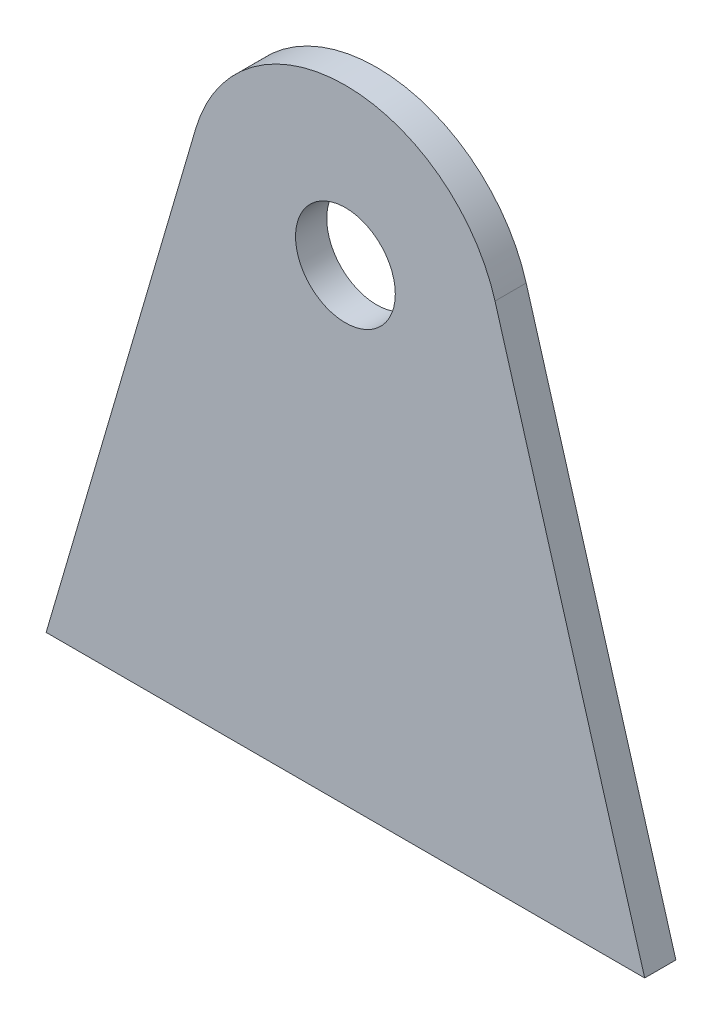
ISO-10303-21;
HEADER;
FILE_DESCRIPTION(('STEP AP214'),'2;1');
FILE_NAME('part.step','',(''),(''),'','','');
FILE_SCHEMA(('AUTOMOTIVE_DESIGN { 1 0 10303 214 1 1 1 1 }'));
ENDSEC;
DATA;
#1=APPLICATION_CONTEXT('core data for automotive mechanical design processes');
#2=APPLICATION_PROTOCOL_DEFINITION('international standard','automotive_design',2000,#1);
#3=PRODUCT_CONTEXT('',#1,'mechanical');
#4=PRODUCT('Part','Part','',(#3));
#5=PRODUCT_RELATED_PRODUCT_CATEGORY('part','',(#4));
#6=PRODUCT_DEFINITION_FORMATION('','',#4);
#7=PRODUCT_DEFINITION_CONTEXT('part definition',#1,'design');
#8=PRODUCT_DEFINITION('design','',#6,#7);
#9=PRODUCT_DEFINITION_SHAPE('','',#8);
#10=(LENGTH_UNIT() NAMED_UNIT(*) SI_UNIT(.MILLI.,.METRE.));
#11=(NAMED_UNIT(*) PLANE_ANGLE_UNIT() SI_UNIT($,.RADIAN.));
#12=(NAMED_UNIT(*) SI_UNIT($,.STERADIAN.) SOLID_ANGLE_UNIT());
#13=UNCERTAINTY_MEASURE_WITH_UNIT(LENGTH_MEASURE(1.E-05),#10,'distance_accuracy_value','');
#14=(GEOMETRIC_REPRESENTATION_CONTEXT(3) GLOBAL_UNCERTAINTY_ASSIGNED_CONTEXT((#13)) GLOBAL_UNIT_ASSIGNED_CONTEXT((#10,
#11,#12)) REPRESENTATION_CONTEXT('',''));
#15=CARTESIAN_POINT('',(0.,0.,0.));
#16=DIRECTION('',(0.,0.,1.));
#17=DIRECTION('',(1.,0.,0.));
#18=AXIS2_PLACEMENT_3D('',#15,#16,#17);
#19=CARTESIAN_POINT('',(0.,75.,5.));
#20=DIRECTION('',(0.,0.,1.));
#21=DIRECTION('',(1.,0.,0.));
#22=AXIS2_PLACEMENT_3D('',#19,#20,#21);
#23=PLANE('',#22);
#24=DIRECTION('',(-0.28089863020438,-0.959737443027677,0.));
#25=VECTOR('',#24,1.);
#26=CARTESIAN_POINT('',(-48.,0.,5.));
#27=LINE('',#26,#25);
#28=CARTESIAN_POINT('',(-23.9934360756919,82.0224657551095,5.));
#29=VERTEX_POINT('',#28);
#30=CARTESIAN_POINT('',(-48.,0.,5.));
#31=VERTEX_POINT('',#30);
#32=EDGE_CURVE('E95',#29,#31,#27,.T.);
#33=ORIENTED_EDGE('',*,*,#32,.T.);
#34=DIRECTION('',(1.,0.,0.));
#35=VECTOR('',#34,1.);
#36=CARTESIAN_POINT('',(-48.,0.,5.));
#37=LINE('',#36,#35);
#38=CARTESIAN_POINT('',(48.,0.,5.));
#39=VERTEX_POINT('',#38);
#40=EDGE_CURVE('E80',#31,#39,#37,.T.);
#41=ORIENTED_EDGE('',*,*,#40,.T.);
#42=DIRECTION('',(-0.28089863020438,0.959737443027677,0.));
#43=VECTOR('',#42,1.);
#44=CARTESIAN_POINT('',(48.,0.,5.));
#45=LINE('',#44,#43);
#46=CARTESIAN_POINT('',(23.9934360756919,82.0224657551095,5.));
#47=VERTEX_POINT('',#46);
#48=EDGE_CURVE('E46',#39,#47,#45,.T.);
#49=ORIENTED_EDGE('',*,*,#48,.T.);
#50=CARTESIAN_POINT('',(0.,75.,5.));
#51=DIRECTION('',(0.,0.,1.));
#52=DIRECTION('',(1.,0.,0.));
#53=AXIS2_PLACEMENT_3D('',#50,#51,#52);
#54=CIRCLE('',#53,25.);
#55=EDGE_CURVE('E41',#47,#29,#54,.T.);
#56=ORIENTED_EDGE('',*,*,#55,.T.);
#57=EDGE_LOOP('',(#33,#41,#49,#56));
#58=FACE_BOUND('',#57,.T.);
#59=CARTESIAN_POINT('',(0.,75.,5.));
#60=DIRECTION('',(0.,0.,1.));
#61=DIRECTION('',(1.,0.,0.));
#62=AXIS2_PLACEMENT_3D('',#59,#60,#61);
#63=CIRCLE('',#62,8.00000000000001);
#64=CARTESIAN_POINT('',(8.00000000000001,75.,5.));
#65=VERTEX_POINT('',#64);
#66=EDGE_CURVE('E85',#65,#65,#63,.T.);
#67=ORIENTED_EDGE('',*,*,#66,.F.);
#68=EDGE_LOOP('',(#67));
#69=FACE_BOUND('',#68,.T.);
#70=ADVANCED_FACE('F26',(#58,#69),#23,.T.);
#71=CARTESIAN_POINT('',(0.,75.,0.));
#72=DIRECTION('',(0.,0.,1.));
#73=DIRECTION('',(1.,0.,0.));
#74=AXIS2_PLACEMENT_3D('',#71,#72,#73);
#75=PLANE('',#74);
#76=DIRECTION('',(-0.28089863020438,-0.959737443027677,0.));
#77=VECTOR('',#76,1.);
#78=CARTESIAN_POINT('',(-48.,0.,0.));
#79=LINE('',#78,#77);
#80=CARTESIAN_POINT('',(-23.9934360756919,82.0224657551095,0.));
#81=VERTEX_POINT('',#80);
#82=CARTESIAN_POINT('',(-48.,0.,0.));
#83=VERTEX_POINT('',#82);
#84=EDGE_CURVE('E72',#81,#83,#79,.T.);
#85=ORIENTED_EDGE('',*,*,#84,.F.);
#86=CARTESIAN_POINT('',(0.,75.,0.));
#87=DIRECTION('',(0.,0.,1.));
#88=DIRECTION('',(1.,0.,0.));
#89=AXIS2_PLACEMENT_3D('',#86,#87,#88);
#90=CIRCLE('',#89,25.);
#91=CARTESIAN_POINT('',(23.9934360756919,82.0224657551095,0.));
#92=VERTEX_POINT('',#91);
#93=EDGE_CURVE('E93',#92,#81,#90,.T.);
#94=ORIENTED_EDGE('',*,*,#93,.F.);
#95=DIRECTION('',(-0.28089863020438,0.959737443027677,0.));
#96=VECTOR('',#95,1.);
#97=CARTESIAN_POINT('',(48.,0.,0.));
#98=LINE('',#97,#96);
#99=CARTESIAN_POINT('',(48.,0.,0.));
#100=VERTEX_POINT('',#99);
#101=EDGE_CURVE('E73',#100,#92,#98,.T.);
#102=ORIENTED_EDGE('',*,*,#101,.F.);
#103=DIRECTION('',(1.,0.,0.));
#104=VECTOR('',#103,1.);
#105=CARTESIAN_POINT('',(-48.,0.,0.));
#106=LINE('',#105,#104);
#107=EDGE_CURVE('E67',#83,#100,#106,.T.);
#108=ORIENTED_EDGE('',*,*,#107,.F.);
#109=EDGE_LOOP('',(#85,#94,#102,#108));
#110=FACE_BOUND('',#109,.T.);
#111=CARTESIAN_POINT('',(0.,75.,0.));
#112=DIRECTION('',(0.,0.,1.));
#113=DIRECTION('',(1.,0.,0.));
#114=AXIS2_PLACEMENT_3D('',#111,#112,#113);
#115=CIRCLE('',#114,8.00000000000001);
#116=CARTESIAN_POINT('',(8.00000000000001,75.,0.));
#117=VERTEX_POINT('',#116);
#118=EDGE_CURVE('E88',#117,#117,#115,.T.);
#119=ORIENTED_EDGE('',*,*,#118,.T.);
#120=EDGE_LOOP('',(#119));
#121=FACE_BOUND('',#120,.T.);
#122=ADVANCED_FACE('F68',(#110,#121),#75,.F.);
#123=CARTESIAN_POINT('',(-48.,0.,5.));
#124=DIRECTION('',(0.959737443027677,-0.28089863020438,0.));
#125=DIRECTION('',(0.28089863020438,0.959737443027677,0.));
#126=AXIS2_PLACEMENT_3D('',#123,#124,#125);
#127=PLANE('',#126);
#128=ORIENTED_EDGE('',*,*,#84,.T.);
#129=DIRECTION('',(0.,0.,-1.));
#130=VECTOR('',#129,1.);
#131=CARTESIAN_POINT('',(-48.,0.,5.));
#132=LINE('',#131,#130);
#133=EDGE_CURVE('E11',#31,#83,#132,.T.);
#134=ORIENTED_EDGE('',*,*,#133,.F.);
#135=ORIENTED_EDGE('',*,*,#32,.F.);
#136=DIRECTION('',(0.,0.,-1.));
#137=VECTOR('',#136,1.);
#138=CARTESIAN_POINT('',(-23.9934360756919,82.0224657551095,5.));
#139=LINE('',#138,#137);
#140=EDGE_CURVE('E84',#29,#81,#139,.T.);
#141=ORIENTED_EDGE('',*,*,#140,.T.);
#142=EDGE_LOOP('',(#128,#134,#135,#141));
#143=FACE_BOUND('',#142,.T.);
#144=ADVANCED_FACE('F28',(#143),#127,.F.);
#145=CARTESIAN_POINT('',(-48.,0.,5.));
#146=DIRECTION('',(0.,1.,0.));
#147=DIRECTION('',(0.,0.,1.));
#148=AXIS2_PLACEMENT_3D('',#145,#146,#147);
#149=PLANE('',#148);
#150=ORIENTED_EDGE('',*,*,#107,.T.);
#151=DIRECTION('',(0.,0.,-1.));
#152=VECTOR('',#151,1.);
#153=CARTESIAN_POINT('',(48.,0.,5.));
#154=LINE('',#153,#152);
#155=EDGE_CURVE('E34',#39,#100,#154,.T.);
#156=ORIENTED_EDGE('',*,*,#155,.F.);
#157=ORIENTED_EDGE('',*,*,#40,.F.);
#158=ORIENTED_EDGE('',*,*,#133,.T.);
#159=EDGE_LOOP('',(#150,#156,#157,#158));
#160=FACE_BOUND('',#159,.T.);
#161=ADVANCED_FACE('F79',(#160),#149,.F.);
#162=CARTESIAN_POINT('',(48.,0.,5.));
#163=DIRECTION('',(-0.959737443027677,-0.28089863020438,0.));
#164=DIRECTION('',(0.28089863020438,-0.959737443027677,0.));
#165=AXIS2_PLACEMENT_3D('',#162,#163,#164);
#166=PLANE('',#165);
#167=ORIENTED_EDGE('',*,*,#101,.T.);
#168=DIRECTION('',(0.,0.,-1.));
#169=VECTOR('',#168,1.);
#170=CARTESIAN_POINT('',(23.9934360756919,82.0224657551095,5.));
#171=LINE('',#170,#169);
#172=EDGE_CURVE('E101',#47,#92,#171,.T.);
#173=ORIENTED_EDGE('',*,*,#172,.F.);
#174=ORIENTED_EDGE('',*,*,#48,.F.);
#175=ORIENTED_EDGE('',*,*,#155,.T.);
#176=EDGE_LOOP('',(#167,#173,#174,#175));
#177=FACE_BOUND('',#176,.T.);
#178=ADVANCED_FACE('F104',(#177),#166,.F.);
#179=CARTESIAN_POINT('',(0.,75.,5.));
#180=DIRECTION('',(0.,0.,-1.));
#181=DIRECTION('',(-1.,0.,0.));
#182=AXIS2_PLACEMENT_3D('',#179,#180,#181);
#183=CYLINDRICAL_SURFACE('',#182,25.);
#184=ORIENTED_EDGE('',*,*,#93,.T.);
#185=ORIENTED_EDGE('',*,*,#140,.F.);
#186=ORIENTED_EDGE('',*,*,#55,.F.);
#187=ORIENTED_EDGE('',*,*,#172,.T.);
#188=EDGE_LOOP('',(#184,#185,#186,#187));
#189=FACE_BOUND('',#188,.T.);
#190=ADVANCED_FACE('F106',(#189),#183,.T.);
#191=CARTESIAN_POINT('',(0.,75.,5.));
#192=DIRECTION('',(0.,0.,-1.));
#193=DIRECTION('',(-1.,0.,0.));
#194=AXIS2_PLACEMENT_3D('',#191,#192,#193);
#195=CYLINDRICAL_SURFACE('',#194,8.00000000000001);
#196=ORIENTED_EDGE('',*,*,#66,.T.);
#197=EDGE_LOOP('',(#196));
#198=FACE_BOUND('',#197,.T.);
#199=ORIENTED_EDGE('',*,*,#118,.F.);
#200=EDGE_LOOP('',(#199));
#201=FACE_BOUND('',#200,.T.);
#202=ADVANCED_FACE('F112',(#198,#201),#195,.F.);
#203=CLOSED_SHELL('',(#70,#122,#144,#161,#178,#190,#202));
#204=MANIFOLD_SOLID_BREP('B2',#203);
#205=ADVANCED_BREP_SHAPE_REPRESENTATION('',(#18,#204),#14);
#206=SHAPE_DEFINITION_REPRESENTATION(#9,#205);
ENDSEC;
END-ISO-10303-21;
